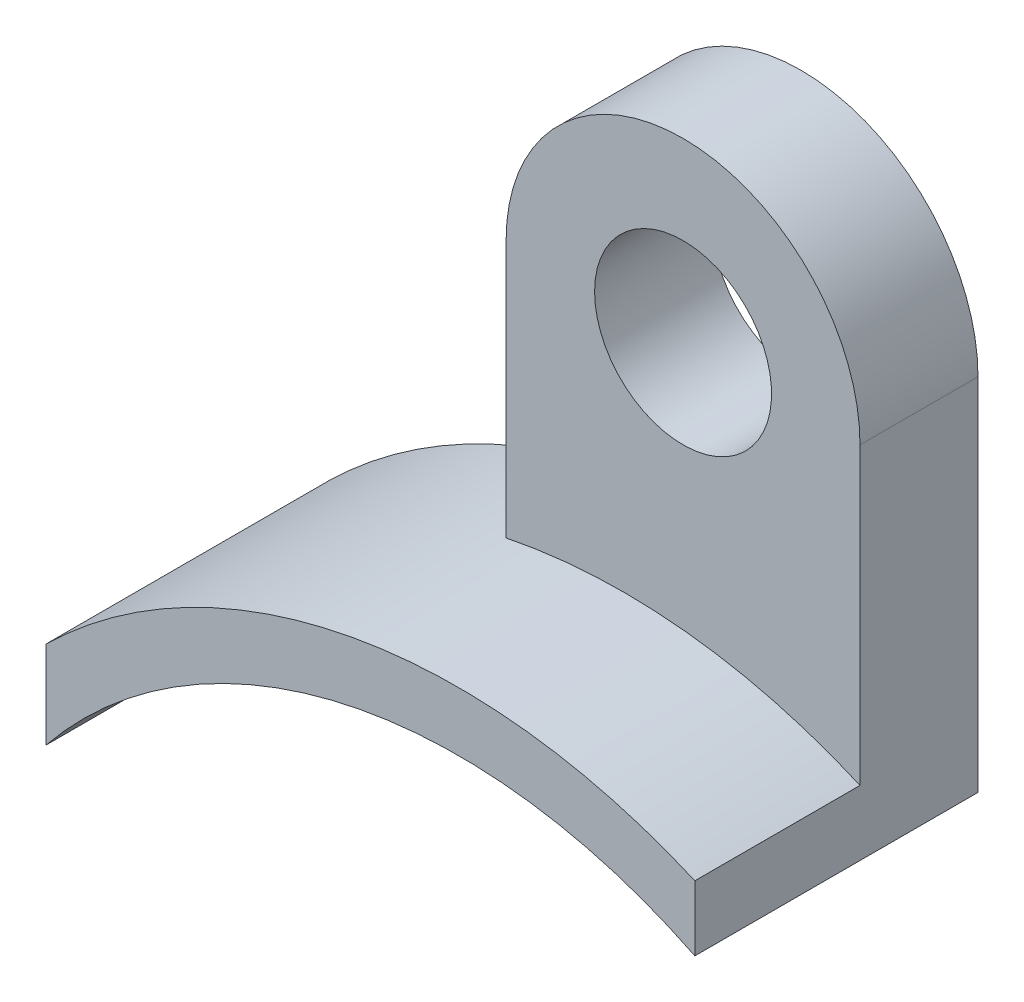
from build123d import *

# Parameters (mm, degrees)
EXTRUDE_1_DEPTH = 24
SKETCH_2_R      = 7.5
EXTRUDE_2_DEPTH = 10


with BuildPart() as part:
    # Sketch 1 → Extrude 1 (new body)
    with BuildSketch(Plane.XY):
        with BuildLine():
            Line((-35, 35.707142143), (-35, 28.284271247))
            ThreePointArc((-35, 28.284271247), (-9.613130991, 43.961206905), (20, 40.311288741))
            Line((20, 40.311288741), (20, 45.82575695))
            ThreePointArc((20, 45.82575695), (-9.0469106, 49.174723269), (-35, 35.707142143))
        make_face()
    extrude(amount=EXTRUDE_1_DEPTH)

    # Sketch 2 → Extrude 2 (add)
    with BuildSketch(Plane(origin=(0, 0, 0), x_dir=(-1, 0, 0), z_dir=(0, 0, -1))):
        with BuildLine():
            Line((-20, 45.82575695), (-20, 70.82575695))
            ThreePointArc((-20, 70.82575695), (-5, 85.82575695), (10, 70.82575695))
            Line((10, 70.82575695), (10, 48.989794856))
            ThreePointArc((10, 48.989794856), (-5.244309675, 49.724211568), (-20, 45.82575695))
        make_face()
        with Locations((-5, 70.82575695)):
            Circle(SKETCH_2_R, mode=Mode.SUBTRACT)
    extrude(amount=-EXTRUDE_2_DEPTH)


solid = part.part
